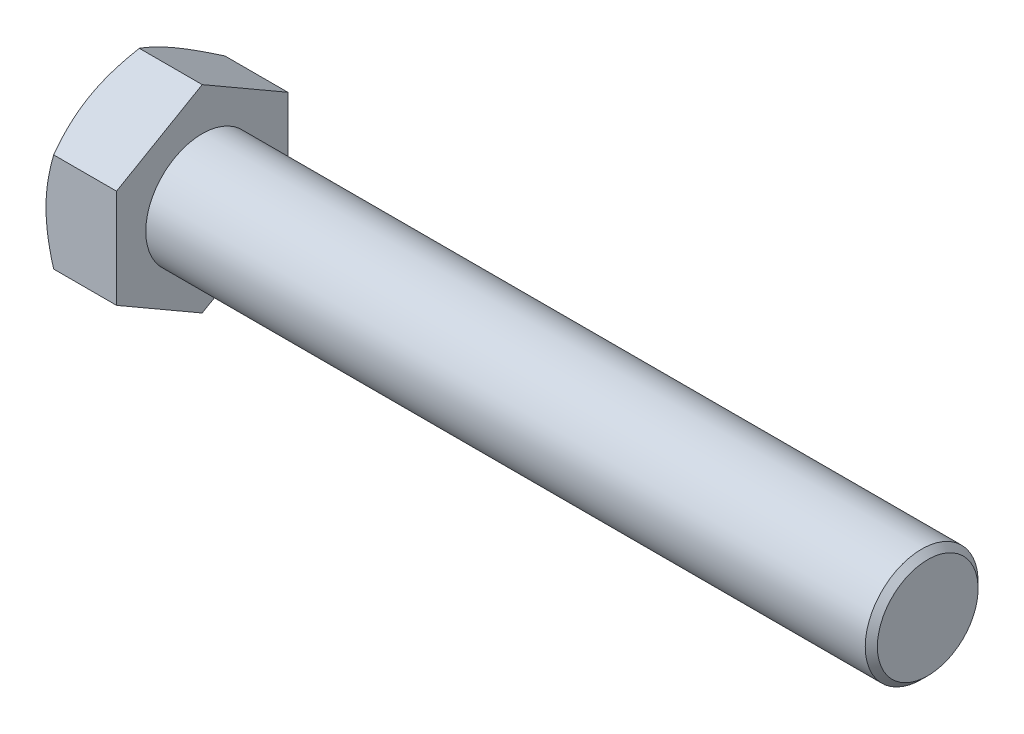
ISO-10303-21;
HEADER;
FILE_DESCRIPTION(('STEP AP214'),'2;1');
FILE_NAME('part.step','',(''),(''),'','','');
FILE_SCHEMA(('AUTOMOTIVE_DESIGN { 1 0 10303 214 1 1 1 1 }'));
ENDSEC;
DATA;
#1=APPLICATION_CONTEXT('core data for automotive mechanical design processes');
#2=APPLICATION_PROTOCOL_DEFINITION('international standard','automotive_design',2000,#1);
#3=PRODUCT_CONTEXT('',#1,'mechanical');
#4=PRODUCT('Part','Part','',(#3));
#5=PRODUCT_RELATED_PRODUCT_CATEGORY('part','',(#4));
#6=PRODUCT_DEFINITION_FORMATION('','',#4);
#7=PRODUCT_DEFINITION_CONTEXT('part definition',#1,'design');
#8=PRODUCT_DEFINITION('design','',#6,#7);
#9=PRODUCT_DEFINITION_SHAPE('','',#8);
#10=(LENGTH_UNIT() NAMED_UNIT(*) SI_UNIT(.MILLI.,.METRE.));
#11=(NAMED_UNIT(*) PLANE_ANGLE_UNIT() SI_UNIT($,.RADIAN.));
#12=(NAMED_UNIT(*) SI_UNIT($,.STERADIAN.) SOLID_ANGLE_UNIT());
#13=UNCERTAINTY_MEASURE_WITH_UNIT(LENGTH_MEASURE(1.E-05),#10,'distance_accuracy_value','');
#14=(GEOMETRIC_REPRESENTATION_CONTEXT(3) GLOBAL_UNCERTAINTY_ASSIGNED_CONTEXT((#13)) GLOBAL_UNIT_ASSIGNED_CONTEXT((#10,
#11,#12)) REPRESENTATION_CONTEXT('',''));
#15=CARTESIAN_POINT('',(0.,0.,0.));
#16=DIRECTION('',(0.,0.,1.));
#17=DIRECTION('',(1.,0.,0.));
#18=AXIS2_PLACEMENT_3D('',#15,#16,#17);
#19=CARTESIAN_POINT('',(35.,73.6121593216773,42.5));
#20=DIRECTION('',(1.,0.,0.));
#21=DIRECTION('',(0.,0.,-1.));
#22=AXIS2_PLACEMENT_3D('',#19,#20,#21);
#23=PLANE('',#22);
#24=DIRECTION('',(0.,0.5,0.866025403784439));
#25=VECTOR('',#24,1.);
#26=CARTESIAN_POINT('',(35.,24.5373864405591,-42.5));
#27=LINE('',#26,#25);
#28=CARTESIAN_POINT('',(35.,24.5373864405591,-42.5));
#29=VERTEX_POINT('',#28);
#30=CARTESIAN_POINT('',(35.,49.0747728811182,0.));
#31=VERTEX_POINT('',#30);
#32=EDGE_CURVE('E151',#29,#31,#27,.T.);
#33=ORIENTED_EDGE('',*,*,#32,.T.);
#34=DIRECTION('',(0.,-0.5,0.866025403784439));
#35=VECTOR('',#34,1.);
#36=CARTESIAN_POINT('',(35.,49.0747728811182,0.));
#37=LINE('',#36,#35);
#38=CARTESIAN_POINT('',(35.,24.5373864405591,42.5));
#39=VERTEX_POINT('',#38);
#40=EDGE_CURVE('E149',#31,#39,#37,.T.);
#41=ORIENTED_EDGE('',*,*,#40,.T.);
#42=DIRECTION('',(0.,-1.,0.));
#43=VECTOR('',#42,1.);
#44=CARTESIAN_POINT('',(35.,24.5373864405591,42.5));
#45=LINE('',#44,#43);
#46=CARTESIAN_POINT('',(35.,-24.5373864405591,42.5));
#47=VERTEX_POINT('',#46);
#48=EDGE_CURVE('E126',#39,#47,#45,.T.);
#49=ORIENTED_EDGE('',*,*,#48,.T.);
#50=DIRECTION('',(0.,-0.5,-0.866025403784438));
#51=VECTOR('',#50,1.);
#52=CARTESIAN_POINT('',(35.,-24.5373864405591,42.5));
#53=LINE('',#52,#51);
#54=CARTESIAN_POINT('',(35.,-49.0747728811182,0.));
#55=VERTEX_POINT('',#54);
#56=EDGE_CURVE('E146',#47,#55,#53,.T.);
#57=ORIENTED_EDGE('',*,*,#56,.T.);
#58=DIRECTION('',(0.,0.5,-0.866025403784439));
#59=VECTOR('',#58,1.);
#60=CARTESIAN_POINT('',(35.,-49.0747728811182,0.));
#61=LINE('',#60,#59);
#62=CARTESIAN_POINT('',(35.,-24.5373864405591,-42.5));
#63=VERTEX_POINT('',#62);
#64=EDGE_CURVE('E144',#55,#63,#61,.T.);
#65=ORIENTED_EDGE('',*,*,#64,.T.);
#66=DIRECTION('',(0.,1.,0.));
#67=VECTOR('',#66,1.);
#68=CARTESIAN_POINT('',(35.,-24.5373864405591,-42.5));
#69=LINE('',#68,#67);
#70=EDGE_CURVE('E142',#63,#29,#69,.T.);
#71=ORIENTED_EDGE('',*,*,#70,.T.);
#72=EDGE_LOOP('',(#33,#41,#49,#57,#65,#71));
#73=FACE_BOUND('',#72,.T.);
#74=CARTESIAN_POINT('',(35.,0.,0.));
#75=DIRECTION('',(1.,0.,0.));
#76=DIRECTION('',(0.,0.,-1.));
#77=AXIS2_PLACEMENT_3D('',#74,#75,#76);
#78=CIRCLE('',#77,28.);
#79=CARTESIAN_POINT('',(35.,0.,-28.));
#80=VERTEX_POINT('',#79);
#81=EDGE_CURVE('E244',#80,#80,#78,.F.);
#82=ORIENTED_EDGE('',*,*,#81,.T.);
#83=EDGE_LOOP('',(#82));
#84=FACE_BOUND('',#83,.T.);
#85=ADVANCED_FACE('F33',(#73,#84),#23,.T.);
#86=CARTESIAN_POINT('',(35.,24.5373864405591,-42.5));
#87=DIRECTION('',(0.,-0.866025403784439,0.5));
#88=DIRECTION('',(0.,-0.5,-0.866025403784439));
#89=AXIS2_PLACEMENT_3D('',#86,#87,#88);
#90=PLANE('',#89);
#91=CARTESIAN_POINT('',(3.79601355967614,49.074888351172,0.000199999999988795));
#92=CARTESIAN_POINT('',(3.4846612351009,48.5355680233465,-0.933930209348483));
#93=CARTESIAN_POINT('',(3.18743784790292,47.9941440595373,-1.87170402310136));
#94=CARTESIAN_POINT('',(2.62517624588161,46.90695457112,-3.75477145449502));
#95=CARTESIAN_POINT('',(2.36014861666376,46.361187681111,-4.70006743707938));
#96=CARTESIAN_POINT('',(1.86583585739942,45.264245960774,-6.60002622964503));
#97=CARTESIAN_POINT('',(1.63663608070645,44.7130614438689,-7.55470581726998));
#98=CARTESIAN_POINT('',(1.21891652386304,43.6068859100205,-9.4706580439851));
#99=CARTESIAN_POINT('',(1.0303926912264,43.0518952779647,-10.4319300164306));
#100=CARTESIAN_POINT('',(0.702027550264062,41.9522934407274,-12.3364962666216));
#101=CARTESIAN_POINT('',(0.561100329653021,41.407763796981,-13.2796492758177));
#102=CARTESIAN_POINT('',(0.324798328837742,40.3162094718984,-15.1702768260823));
#103=CARTESIAN_POINT('',(0.229424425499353,39.7691847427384,-16.1177514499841));
#104=CARTESIAN_POINT('',(0.0866371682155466,38.6742164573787,-18.0142921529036));
#105=CARTESIAN_POINT('',(0.0391668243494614,38.1262747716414,-18.9633549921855));
#106=CARTESIAN_POINT('',(-0.00679237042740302,37.0298856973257,-20.8623565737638));
#107=CARTESIAN_POINT('',(-0.00528273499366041,36.4814383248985,-21.8122952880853));
#108=CARTESIAN_POINT('',(0.0432959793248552,35.4561136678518,-23.5882096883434));
#109=CARTESIAN_POINT('',(0.0844413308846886,34.9791632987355,-24.4143119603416));
#110=CARTESIAN_POINT('',(0.20299436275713,34.0264000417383,-26.0645463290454));
#111=CARTESIAN_POINT('',(0.280401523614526,33.5505871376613,-26.8886784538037));
#112=CARTESIAN_POINT('',(0.470132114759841,32.6002802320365,-28.5346582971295));
#113=CARTESIAN_POINT('',(0.582487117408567,32.1257878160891,-29.3565032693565));
#114=CARTESIAN_POINT('',(0.840141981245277,31.1790583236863,-30.996286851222));
#115=CARTESIAN_POINT('',(0.98544170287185,30.7068212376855,-31.8142254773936));
#116=CARTESIAN_POINT('',(1.31023640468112,29.7545766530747,-33.4635614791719));
#117=CARTESIAN_POINT('',(1.49041542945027,29.2746277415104,-34.2948573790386));
#118=CARTESIAN_POINT('',(1.88016163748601,28.3176673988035,-35.9523613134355));
#119=CARTESIAN_POINT('',(2.08973280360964,27.8406563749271,-36.77856864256));
#120=CARTESIAN_POINT('',(2.53509189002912,26.8906903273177,-38.4239581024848));
#121=CARTESIAN_POINT('',(2.77082850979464,26.4177292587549,-39.2431507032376));
#122=CARTESIAN_POINT('',(3.26616671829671,25.4750783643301,-40.8758699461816));
#123=CARTESIAN_POINT('',(3.5257615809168,25.0053876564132,-41.6893981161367));
#124=CARTESIAN_POINT('',(3.79601355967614,24.5372709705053,-42.5002));
#125=B_SPLINE_CURVE_WITH_KNOTS('',3,(#91,#92,#93,#94,#95,#96,#97,#98,#99,#100,#101,#102,#103,
#104,#105,#106,#107,#108,#109,#110,#111,#112,#113,#114,#115,#116,#117,#118,#119,#120,#121,#122,
#123,#124),.UNSPECIFIED.,.F.,.F.,(4,2,2,2,2,2,2,2,2,2,2,2,2,2,2,2,4),(0.,3.36812217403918,
6.73734876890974,10.1144834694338,13.4912815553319,16.7848038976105,20.0783896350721,
23.3680524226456,26.6576135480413,29.52128658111,32.3849185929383,35.2511452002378,
38.1173596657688,41.0468447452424,43.9767271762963,46.9009634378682,49.824377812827),.UNSPECIFIED.);
#126=CARTESIAN_POINT('',(3.79594689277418,49.0747728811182,0.));
#127=VERTEX_POINT('',#126);
#128=CARTESIAN_POINT('',(0.,36.8060796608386,-21.25));
#129=VERTEX_POINT('',#128);
#130=EDGE_CURVE('E50',#127,#129,#125,.T.);
#131=ORIENTED_EDGE('',*,*,#130,.F.);
#132=DIRECTION('',(-1.,0.,0.));
#133=VECTOR('',#132,1.);
#134=CARTESIAN_POINT('',(35.,49.0747728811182,0.));
#135=LINE('',#134,#133);
#136=EDGE_CURVE('E127',#31,#127,#135,.T.);
#137=ORIENTED_EDGE('',*,*,#136,.F.);
#138=ORIENTED_EDGE('',*,*,#32,.F.);
#139=DIRECTION('',(-1.,0.,0.));
#140=VECTOR('',#139,1.);
#141=CARTESIAN_POINT('',(35.,24.5373864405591,-42.5));
#142=LINE('',#141,#140);
#143=CARTESIAN_POINT('',(3.79594689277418,24.5373864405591,-42.5));
#144=VERTEX_POINT('',#143);
#145=EDGE_CURVE('E139',#29,#144,#142,.T.);
#146=ORIENTED_EDGE('',*,*,#145,.T.);
#147=EDGE_CURVE('E198',#129,#144,#125,.T.);
#148=ORIENTED_EDGE('',*,*,#147,.F.);
#149=EDGE_LOOP('',(#131,#137,#138,#146,#148));
#150=FACE_BOUND('',#149,.T.);
#151=ADVANCED_FACE('F35',(#150),#90,.F.);
#152=CARTESIAN_POINT('',(35.,49.0747728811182,0.));
#153=DIRECTION('',(0.,-0.866025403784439,-0.5));
#154=DIRECTION('',(0.,0.5,-0.866025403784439));
#155=AXIS2_PLACEMENT_3D('',#152,#153,#154);
#156=PLANE('',#155);
#157=CARTESIAN_POINT('',(3.79601355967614,24.5372709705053,42.5002));
#158=CARTESIAN_POINT('',(3.48466123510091,25.0765912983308,41.5660697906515));
#159=CARTESIAN_POINT('',(3.18743784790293,25.61801526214,40.6282959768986));
#160=CARTESIAN_POINT('',(2.62517624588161,26.7052047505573,38.745228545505));
#161=CARTESIAN_POINT('',(2.36014861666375,27.2509716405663,37.7999325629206));
#162=CARTESIAN_POINT('',(1.86583585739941,28.3479133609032,35.899973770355));
#163=CARTESIAN_POINT('',(1.63663608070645,28.8990978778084,34.94529418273));
#164=CARTESIAN_POINT('',(1.21891652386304,30.0052734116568,33.0293419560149));
#165=CARTESIAN_POINT('',(1.0303926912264,30.5602640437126,32.0680699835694));
#166=CARTESIAN_POINT('',(0.702027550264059,31.6598658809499,30.1635037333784));
#167=CARTESIAN_POINT('',(0.56110032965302,32.2043955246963,29.2203507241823));
#168=CARTESIAN_POINT('',(0.324798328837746,33.2959498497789,27.3297231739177));
#169=CARTESIAN_POINT('',(0.229424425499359,33.8429745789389,26.3822485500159));
#170=CARTESIAN_POINT('',(0.0866371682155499,34.9379428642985,24.4857078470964));
#171=CARTESIAN_POINT('',(0.0391668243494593,35.4858845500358,23.5366450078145));
#172=CARTESIAN_POINT('',(-0.00679237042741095,36.5822736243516,21.6376434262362));
#173=CARTESIAN_POINT('',(-0.00528273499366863,37.1307209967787,20.6877047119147));
#174=CARTESIAN_POINT('',(0.0432959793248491,38.1560456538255,18.9117903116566));
#175=CARTESIAN_POINT('',(0.0844413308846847,38.6329960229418,18.0856880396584));
#176=CARTESIAN_POINT('',(0.202994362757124,39.585759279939,16.4354536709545));
#177=CARTESIAN_POINT('',(0.280401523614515,40.061572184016,15.6113215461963));
#178=CARTESIAN_POINT('',(0.470132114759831,41.0118790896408,13.9653417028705));
#179=CARTESIAN_POINT('',(0.582487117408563,41.4863715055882,13.1434967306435));
#180=CARTESIAN_POINT('',(0.840141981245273,42.433100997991,11.503713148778));
#181=CARTESIAN_POINT('',(0.985441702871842,42.9053380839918,10.6857745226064));
#182=CARTESIAN_POINT('',(1.31023640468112,43.8575826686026,9.03643852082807));
#183=CARTESIAN_POINT('',(1.49041542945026,44.3375315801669,8.20514262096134));
#184=CARTESIAN_POINT('',(1.88016163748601,45.2944919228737,6.54763868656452));
#185=CARTESIAN_POINT('',(2.08973280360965,45.7715029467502,5.72143135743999));
#186=CARTESIAN_POINT('',(2.53509189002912,46.7214689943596,4.07604189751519));
#187=CARTESIAN_POINT('',(2.77082850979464,47.1944300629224,3.2568492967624));
#188=CARTESIAN_POINT('',(3.2661667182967,48.1370809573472,1.62413005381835));
#189=CARTESIAN_POINT('',(3.5257615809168,48.6067716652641,0.810601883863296));
#190=CARTESIAN_POINT('',(3.79601355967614,49.074888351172,-0.000200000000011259));
#191=B_SPLINE_CURVE_WITH_KNOTS('',3,(#157,#158,#159,#160,#161,#162,#163,#164,#165,#166,#167,
#168,#169,#170,#171,#172,#173,#174,#175,#176,#177,#178,#179,#180,#181,#182,#183,#184,#185,#186,
#187,#188,#189,#190),.UNSPECIFIED.,.F.,.F.,(4,2,2,2,2,2,2,2,2,2,2,2,2,2,2,2,4),(0.,
3.36812217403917,6.73734876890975,10.1144834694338,13.4912815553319,16.7848038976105,
20.0783896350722,23.3680524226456,26.6576135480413,29.52128658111,32.3849185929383,
35.2511452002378,38.1173596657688,41.0468447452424,43.9767271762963,46.9009634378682,
49.824377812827),.UNSPECIFIED.);
#192=CARTESIAN_POINT('',(3.79594689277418,24.5373864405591,42.5));
#193=VERTEX_POINT('',#192);
#194=CARTESIAN_POINT('',(0.,36.8060796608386,21.25));
#195=VERTEX_POINT('',#194);
#196=EDGE_CURVE('E57',#193,#195,#191,.T.);
#197=ORIENTED_EDGE('',*,*,#196,.F.);
#198=DIRECTION('',(-1.,0.,0.));
#199=VECTOR('',#198,1.);
#200=CARTESIAN_POINT('',(35.,24.5373864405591,42.5));
#201=LINE('',#200,#199);
#202=EDGE_CURVE('E119',#39,#193,#201,.T.);
#203=ORIENTED_EDGE('',*,*,#202,.F.);
#204=ORIENTED_EDGE('',*,*,#40,.F.);
#205=ORIENTED_EDGE('',*,*,#136,.T.);
#206=EDGE_CURVE('E122',#195,#127,#191,.T.);
#207=ORIENTED_EDGE('',*,*,#206,.F.);
#208=EDGE_LOOP('',(#197,#203,#204,#205,#207));
#209=FACE_BOUND('',#208,.T.);
#210=ADVANCED_FACE('F118',(#209),#156,.F.);
#211=CARTESIAN_POINT('',(35.,24.5373864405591,42.5));
#212=DIRECTION('',(0.,0.,-1.));
#213=DIRECTION('',(-1.,0.,0.));
#214=AXIS2_PLACEMENT_3D('',#211,#212,#213);
#215=PLANE('',#214);
#216=CARTESIAN_POINT('',(20.3373849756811,-65.0767648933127,42.5));
#217=CARTESIAN_POINT('',(19.8864107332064,-64.1438049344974,42.5));
#218=CARTESIAN_POINT('',(19.4377629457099,-63.2097164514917,42.5));
#219=CARTESIAN_POINT('',(18.5456711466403,-61.3390459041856,42.5));
#220=CARTESIAN_POINT('',(18.1022271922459,-60.4024638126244,42.5));
#221=CARTESIAN_POINT('',(17.2210290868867,-58.5264308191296,42.5));
#222=CARTESIAN_POINT('',(16.7832759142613,-57.5869794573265,42.5));
#223=CARTESIAN_POINT('',(15.9141917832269,-55.7051120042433,42.5));
#224=CARTESIAN_POINT('',(15.482860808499,-54.762695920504,42.5));
#225=CARTESIAN_POINT('',(14.6249118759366,-52.8692072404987,42.5));
#226=CARTESIAN_POINT('',(14.1983350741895,-51.9181159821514,42.5));
#227=CARTESIAN_POINT('',(13.3532955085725,-50.0123364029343,42.5));
#228=CARTESIAN_POINT('',(12.9348327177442,-49.0576480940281,42.5));
#229=CARTESIAN_POINT('',(12.1070331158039,-47.1443706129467,42.5));
#230=CARTESIAN_POINT('',(11.6976958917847,-46.1857816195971,42.5));
#231=CARTESIAN_POINT('',(10.8892709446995,-44.2642864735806,42.5));
#232=CARTESIAN_POINT('',(10.490183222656,-43.301380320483,42.5));
#233=CARTESIAN_POINT('',(9.69873914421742,-41.358991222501,42.5));
#234=CARTESIAN_POINT('',(9.30652571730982,-40.3794499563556,42.5));
#235=CARTESIAN_POINT('',(8.53551485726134,-38.415091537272,42.5));
#236=CARTESIAN_POINT('',(8.15671744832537,-37.4302743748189,42.5));
#237=CARTESIAN_POINT('',(7.41429261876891,-35.4547841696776,42.5));
#238=CARTESIAN_POINT('',(7.0506671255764,-34.464110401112,42.5));
#239=CARTESIAN_POINT('',(6.34070151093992,-32.4765835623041,42.5));
#240=CARTESIAN_POINT('',(5.99436131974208,-31.4797305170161,42.5));
#241=CARTESIAN_POINT('',(5.32202587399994,-29.4815411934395,42.5));
#242=CARTESIAN_POINT('',(4.99598844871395,-28.4802191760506,42.5));
#243=CARTESIAN_POINT('',(4.366091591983,-26.4706437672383,42.5));
#244=CARTESIAN_POINT('',(4.06223253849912,-25.4623902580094,42.5));
#245=CARTESIAN_POINT('',(3.18838018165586,-22.4272420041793,42.5));
#246=CARTESIAN_POINT('',(2.65584808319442,-20.3891895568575,42.5));
#247=CARTESIAN_POINT('',(1.95165311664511,-17.3102620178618,42.5));
#248=CARTESIAN_POINT('',(1.73265261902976,-16.2800927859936,42.5));
#249=CARTESIAN_POINT('',(1.32964364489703,-14.2128889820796,42.5));
#250=CARTESIAN_POINT('',(1.14563438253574,-13.1758545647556,42.5));
#251=CARTESIAN_POINT('',(0.81587021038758,-11.0956277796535,42.5));
#252=CARTESIAN_POINT('',(0.670117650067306,-10.0524350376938,42.5));
#253=CARTESIAN_POINT('',(0.419794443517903,-7.96108365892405,42.5));
#254=CARTESIAN_POINT('',(0.315223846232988,-6.91292501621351,42.5));
#255=CARTESIAN_POINT('',(0.150079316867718,-4.81982610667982,42.5));
#256=CARTESIAN_POINT('',(0.0892300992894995,-3.77490769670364,42.5));
#257=CARTESIAN_POINT('',(0.0118497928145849,-1.68343343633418,42.5));
#258=CARTESIAN_POINT('',(-0.00468196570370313,-0.636877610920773,42.5));
#259=CARTESIAN_POINT('',(0.00695889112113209,1.45568967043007,42.5));
#260=CARTESIAN_POINT('',(0.0351191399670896,2.5017011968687,42.5));
#261=CARTESIAN_POINT('',(0.135465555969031,4.59165687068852,42.5));
#262=CARTESIAN_POINT('',(0.20765366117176,5.63560092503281,42.5));
#263=CARTESIAN_POINT('',(0.367668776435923,7.42128904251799,42.5));
#264=CARTESIAN_POINT('',(0.445101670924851,8.16398533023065,42.5));
#265=CARTESIAN_POINT('',(0.620690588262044,9.6469331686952,42.5));
#266=CARTESIAN_POINT('',(0.718847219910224,10.3871846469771,42.5));
#267=CARTESIAN_POINT('',(1.04295711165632,12.6037313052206,42.5));
#268=CARTESIAN_POINT('',(1.29854540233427,14.0757647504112,42.5));
#269=CARTESIAN_POINT('',(1.88009693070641,17.0089295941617,42.5));
#270=CARTESIAN_POINT('',(2.20621102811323,18.4700305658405,42.5));
#271=CARTESIAN_POINT('',(2.91867799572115,21.3773037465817,42.5));
#272=CARTESIAN_POINT('',(3.30502860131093,22.8234765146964,42.5));
#273=CARTESIAN_POINT('',(4.13838357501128,25.7349070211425,42.5));
#274=CARTESIAN_POINT('',(4.58659928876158,27.1998153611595,42.5));
#275=CARTESIAN_POINT('',(5.52765504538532,30.1153033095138,42.5));
#276=CARTESIAN_POINT('',(6.02049911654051,31.5658816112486,42.5));
#277=CARTESIAN_POINT('',(6.78613919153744,33.7277418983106,42.5));
#278=CARTESIAN_POINT('',(7.04497697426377,34.444015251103,42.5));
#279=CARTESIAN_POINT('',(7.57104172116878,35.8734846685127,42.5));
#280=CARTESIAN_POINT('',(7.83826874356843,36.5866807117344,42.5));
#281=CARTESIAN_POINT('',(8.38027540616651,38.0099126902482,42.5));
#282=CARTESIAN_POINT('',(8.65505243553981,38.7199496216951,42.5));
#283=CARTESIAN_POINT('',(9.21159032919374,40.1372592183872,42.5));
#284=CARTESIAN_POINT('',(9.49335099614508,40.8445319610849,42.5));
#285=CARTESIAN_POINT('',(9.77828319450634,41.5505180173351,42.5));
#286=B_SPLINE_CURVE_WITH_KNOTS('',3,(#216,#217,#218,#219,#220,#221,#222,#223,#224,#225,#226,
#227,#228,#229,#230,#231,#232,#233,#234,#235,#236,#237,#238,#239,#240,#241,#242,#243,#244,#245,
#246,#247,#248,#249,#250,#251,#252,#253,#254,#255,#256,#257,#258,#259,#260,#261,#262,#263,#264,
#265,#266,#267,#268,#269,#270,#271,#272,#273,#274,#275,#276,#277,#278,#279,#280,#281,#282,#283,
#284,#285),.UNSPECIFIED.,.F.,.F.,(4,2,2,2,2,2,2,2,2,2,2,2,2,2,2,2,2,2,2,2,2,2,2,2,2,2,2,2,2,2,2,
2,2,2,4),(0.,3.10872020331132,6.21747453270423,9.32675642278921,12.4360304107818,
15.5631168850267,18.6901929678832,21.8171272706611,24.9440618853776,28.1094116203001,
31.2747670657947,34.4405234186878,37.6062669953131,40.7651991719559,43.924185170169,
50.2397177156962,53.398810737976,56.5578328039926,59.7170488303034,62.8762686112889,
66.0154182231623,69.1545204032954,72.292754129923,75.4311260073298,77.6710037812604,
79.9109473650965,84.390996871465,88.8807260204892,93.3702864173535,97.9652822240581,
102.560693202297,104.845472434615,107.130267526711,109.414282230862,111.698232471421),.UNSPECIFIED.);
#287=CARTESIAN_POINT('',(3.79594689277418,-24.5373864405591,42.5));
#288=VERTEX_POINT('',#287);
#289=CARTESIAN_POINT('',(0.,0.,42.5));
#290=VERTEX_POINT('',#289);
#291=EDGE_CURVE('E112',#288,#290,#286,.T.);
#292=ORIENTED_EDGE('',*,*,#291,.F.);
#293=DIRECTION('',(-1.,0.,0.));
#294=VECTOR('',#293,1.);
#295=CARTESIAN_POINT('',(35.,-24.5373864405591,42.5));
#296=LINE('',#295,#294);
#297=EDGE_CURVE('E128',#47,#288,#296,.T.);
#298=ORIENTED_EDGE('',*,*,#297,.F.);
#299=ORIENTED_EDGE('',*,*,#48,.F.);
#300=ORIENTED_EDGE('',*,*,#202,.T.);
#301=EDGE_CURVE('E104',#290,#193,#286,.T.);
#302=ORIENTED_EDGE('',*,*,#301,.F.);
#303=EDGE_LOOP('',(#292,#298,#299,#300,#302));
#304=FACE_BOUND('',#303,.T.);
#305=ADVANCED_FACE('F124',(#304),#215,.F.);
#306=CARTESIAN_POINT('',(35.,-24.5373864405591,42.5));
#307=DIRECTION('',(0.,0.866025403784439,-0.5));
#308=DIRECTION('',(0.,0.5,0.866025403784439));
#309=AXIS2_PLACEMENT_3D('',#306,#307,#308);
#310=PLANE('',#309);
#311=CARTESIAN_POINT('',(3.79601355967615,-49.074888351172,-0.000199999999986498));
#312=CARTESIAN_POINT('',(3.48466123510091,-48.5355680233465,0.933930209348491));
#313=CARTESIAN_POINT('',(3.18743784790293,-47.9941440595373,1.87170402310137));
#314=CARTESIAN_POINT('',(2.62517624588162,-46.90695457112,3.75477145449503));
#315=CARTESIAN_POINT('',(2.36014861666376,-46.361187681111,4.70006743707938));
#316=CARTESIAN_POINT('',(1.86583585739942,-45.264245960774,6.60002622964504));
#317=CARTESIAN_POINT('',(1.63663608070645,-44.7130614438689,7.55470581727));
#318=CARTESIAN_POINT('',(1.21891652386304,-43.6068859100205,9.47065804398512));
#319=CARTESIAN_POINT('',(1.03039269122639,-43.0518952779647,10.4319300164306));
#320=CARTESIAN_POINT('',(0.702027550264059,-41.9522934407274,12.3364962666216));
#321=CARTESIAN_POINT('',(0.561100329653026,-41.407763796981,13.2796492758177));
#322=CARTESIAN_POINT('',(0.324798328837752,-40.3162094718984,15.1702768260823));
#323=CARTESIAN_POINT('',(0.22942442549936,-39.7691847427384,16.1177514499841));
#324=CARTESIAN_POINT('',(0.0866371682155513,-38.6742164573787,18.0142921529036));
#325=CARTESIAN_POINT('',(0.0391668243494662,-38.1262747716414,18.9633549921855));
#326=CARTESIAN_POINT('',(-0.00679237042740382,-37.0298856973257,20.8623565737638));
#327=CARTESIAN_POINT('',(-0.00528273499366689,-36.4814383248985,21.8122952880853));
#328=CARTESIAN_POINT('',(0.0432959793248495,-35.4561136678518,23.5882096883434));
#329=CARTESIAN_POINT('',(0.084441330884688,-34.9791632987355,24.4143119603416));
#330=CARTESIAN_POINT('',(0.202994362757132,-34.0264000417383,26.0645463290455));
#331=CARTESIAN_POINT('',(0.280401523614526,-33.5505871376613,26.8886784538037));
#332=CARTESIAN_POINT('',(0.470132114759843,-32.6002802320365,28.5346582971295));
#333=CARTESIAN_POINT('',(0.582487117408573,-32.1257878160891,29.3565032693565));
#334=CARTESIAN_POINT('',(0.840141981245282,-31.1790583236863,30.996286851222));
#335=CARTESIAN_POINT('',(0.98544170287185,-30.7068212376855,31.8142254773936));
#336=CARTESIAN_POINT('',(1.31023640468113,-29.7545766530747,33.4635614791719));
#337=CARTESIAN_POINT('',(1.49041542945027,-29.2746277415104,34.2948573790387));
#338=CARTESIAN_POINT('',(1.88016163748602,-28.3176673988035,35.9523613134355));
#339=CARTESIAN_POINT('',(2.08973280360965,-27.8406563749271,36.77856864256));
#340=CARTESIAN_POINT('',(2.53509189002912,-26.8906903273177,38.4239581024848));
#341=CARTESIAN_POINT('',(2.77082850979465,-26.4177292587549,39.2431507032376));
#342=CARTESIAN_POINT('',(3.26616671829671,-25.4750783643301,40.8758699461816));
#343=CARTESIAN_POINT('',(3.52576158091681,-25.0053876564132,41.6893981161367));
#344=CARTESIAN_POINT('',(3.79601355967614,-24.5372709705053,42.5002));
#345=B_SPLINE_CURVE_WITH_KNOTS('',3,(#311,#312,#313,#314,#315,#316,#317,#318,#319,#320,#321,
#322,#323,#324,#325,#326,#327,#328,#329,#330,#331,#332,#333,#334,#335,#336,#337,#338,#339,#340,
#341,#342,#343,#344),.UNSPECIFIED.,.F.,.F.,(4,2,2,2,2,2,2,2,2,2,2,2,2,2,2,2,4),(0.,
3.36812217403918,6.73734876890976,10.1144834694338,13.4912815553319,16.7848038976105,
20.0783896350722,23.3680524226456,26.6576135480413,29.52128658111,32.3849185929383,
35.2511452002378,38.1173596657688,41.0468447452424,43.9767271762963,46.9009634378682,
49.824377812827),.UNSPECIFIED.);
#346=CARTESIAN_POINT('',(3.79594689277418,-49.0747728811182,0.));
#347=VERTEX_POINT('',#346);
#348=CARTESIAN_POINT('',(0.,-36.8060796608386,21.25));
#349=VERTEX_POINT('',#348);
#350=EDGE_CURVE('E203',#347,#349,#345,.T.);
#351=ORIENTED_EDGE('',*,*,#350,.F.);
#352=DIRECTION('',(-1.,0.,0.));
#353=VECTOR('',#352,1.);
#354=CARTESIAN_POINT('',(35.,-49.0747728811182,0.));
#355=LINE('',#354,#353);
#356=EDGE_CURVE('E131',#55,#347,#355,.T.);
#357=ORIENTED_EDGE('',*,*,#356,.F.);
#358=ORIENTED_EDGE('',*,*,#56,.F.);
#359=ORIENTED_EDGE('',*,*,#297,.T.);
#360=EDGE_CURVE('E113',#349,#288,#345,.T.);
#361=ORIENTED_EDGE('',*,*,#360,.F.);
#362=EDGE_LOOP('',(#351,#357,#358,#359,#361));
#363=FACE_BOUND('',#362,.T.);
#364=ADVANCED_FACE('F209',(#363),#310,.F.);
#365=CARTESIAN_POINT('',(35.,-49.0747728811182,0.));
#366=DIRECTION('',(0.,0.866025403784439,0.5));
#367=DIRECTION('',(0.,-0.5,0.866025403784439));
#368=AXIS2_PLACEMENT_3D('',#365,#366,#367);
#369=PLANE('',#368);
#370=CARTESIAN_POINT('',(3.79601355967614,-24.5372709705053,-42.5002));
#371=CARTESIAN_POINT('',(3.48466123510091,-25.0765912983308,-41.5660697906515));
#372=CARTESIAN_POINT('',(3.18743784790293,-25.61801526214,-40.6282959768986));
#373=CARTESIAN_POINT('',(2.62517624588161,-26.7052047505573,-38.745228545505));
#374=CARTESIAN_POINT('',(2.36014861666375,-27.2509716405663,-37.7999325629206));
#375=CARTESIAN_POINT('',(1.86583585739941,-28.3479133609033,-35.899973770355));
#376=CARTESIAN_POINT('',(1.63663608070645,-28.8990978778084,-34.94529418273));
#377=CARTESIAN_POINT('',(1.21891652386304,-30.0052734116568,-33.0293419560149));
#378=CARTESIAN_POINT('',(1.0303926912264,-30.5602640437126,-32.0680699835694));
#379=CARTESIAN_POINT('',(0.702027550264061,-31.6598658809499,-30.1635037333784));
#380=CARTESIAN_POINT('',(0.561100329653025,-32.2043955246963,-29.2203507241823));
#381=CARTESIAN_POINT('',(0.32479832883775,-33.2959498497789,-27.3297231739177));
#382=CARTESIAN_POINT('',(0.229424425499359,-33.8429745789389,-26.3822485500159));
#383=CARTESIAN_POINT('',(0.0866371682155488,-34.9379428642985,-24.4857078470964));
#384=CARTESIAN_POINT('',(0.0391668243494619,-35.4858845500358,-23.5366450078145));
#385=CARTESIAN_POINT('',(-0.00679237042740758,-36.5822736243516,-21.6376434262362));
#386=CARTESIAN_POINT('',(-0.00528273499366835,-37.1307209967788,-20.6877047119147));
#387=CARTESIAN_POINT('',(0.0432959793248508,-38.1560456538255,-18.9117903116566));
#388=CARTESIAN_POINT('',(0.0844413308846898,-38.6329960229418,-18.0856880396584));
#389=CARTESIAN_POINT('',(0.202994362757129,-39.585759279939,-16.4354536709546));
#390=CARTESIAN_POINT('',(0.280401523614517,-40.061572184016,-15.6113215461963));
#391=CARTESIAN_POINT('',(0.470132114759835,-41.0118790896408,-13.9653417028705));
#392=CARTESIAN_POINT('',(0.582487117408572,-41.4863715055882,-13.1434967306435));
#393=CARTESIAN_POINT('',(0.840141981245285,-42.433100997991,-11.503713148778));
#394=CARTESIAN_POINT('',(0.985441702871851,-42.9053380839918,-10.6857745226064));
#395=CARTESIAN_POINT('',(1.31023640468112,-43.8575826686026,-9.03643852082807));
#396=CARTESIAN_POINT('',(1.49041542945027,-44.3375315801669,-8.20514262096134));
#397=CARTESIAN_POINT('',(1.88016163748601,-45.2944919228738,-6.54763868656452));
#398=CARTESIAN_POINT('',(2.08973280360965,-45.7715029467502,-5.72143135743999));
#399=CARTESIAN_POINT('',(2.53509189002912,-46.7214689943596,-4.07604189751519));
#400=CARTESIAN_POINT('',(2.77082850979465,-47.1944300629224,-3.2568492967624));
#401=CARTESIAN_POINT('',(3.26616671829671,-48.1370809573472,-1.62413005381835));
#402=CARTESIAN_POINT('',(3.52576158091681,-48.6067716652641,-0.810601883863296));
#403=CARTESIAN_POINT('',(3.79601355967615,-49.074888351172,0.000200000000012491));
#404=B_SPLINE_CURVE_WITH_KNOTS('',3,(#370,#371,#372,#373,#374,#375,#376,#377,#378,#379,#380,
#381,#382,#383,#384,#385,#386,#387,#388,#389,#390,#391,#392,#393,#394,#395,#396,#397,#398,#399,
#400,#401,#402,#403),.UNSPECIFIED.,.F.,.F.,(4,2,2,2,2,2,2,2,2,2,2,2,2,2,2,2,4),(0.,
3.36812217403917,6.73734876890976,10.1144834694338,13.4912815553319,16.7848038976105,
20.0783896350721,23.3680524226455,26.6576135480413,29.52128658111,32.3849185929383,
35.2511452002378,38.1173596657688,41.0468447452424,43.9767271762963,46.9009634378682,
49.824377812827),.UNSPECIFIED.);
#405=CARTESIAN_POINT('',(3.79594689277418,-24.5373864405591,-42.5));
#406=VERTEX_POINT('',#405);
#407=CARTESIAN_POINT('',(0.,-36.8060796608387,-21.25));
#408=VERTEX_POINT('',#407);
#409=EDGE_CURVE('E190',#406,#408,#404,.T.);
#410=ORIENTED_EDGE('',*,*,#409,.F.);
#411=DIRECTION('',(-1.,0.,0.));
#412=VECTOR('',#411,1.);
#413=CARTESIAN_POINT('',(35.,-24.5373864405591,-42.5));
#414=LINE('',#413,#412);
#415=EDGE_CURVE('E136',#63,#406,#414,.T.);
#416=ORIENTED_EDGE('',*,*,#415,.F.);
#417=ORIENTED_EDGE('',*,*,#64,.F.);
#418=ORIENTED_EDGE('',*,*,#356,.T.);
#419=EDGE_CURVE('E208',#408,#347,#404,.T.);
#420=ORIENTED_EDGE('',*,*,#419,.F.);
#421=EDGE_LOOP('',(#410,#416,#417,#418,#420));
#422=FACE_BOUND('',#421,.T.);
#423=ADVANCED_FACE('F212',(#422),#369,.F.);
#424=CARTESIAN_POINT('',(35.,-24.5373864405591,-42.5));
#425=DIRECTION('',(0.,0.,1.));
#426=DIRECTION('',(1.,0.,0.));
#427=AXIS2_PLACEMENT_3D('',#424,#425,#426);
#428=PLANE('',#427);
#429=CARTESIAN_POINT('',(20.3373849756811,-65.0767648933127,-42.5));
#430=CARTESIAN_POINT('',(19.8864107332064,-64.1438049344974,-42.5));
#431=CARTESIAN_POINT('',(19.4377629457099,-63.2097164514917,-42.5));
#432=CARTESIAN_POINT('',(18.5456711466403,-61.3390459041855,-42.5));
#433=CARTESIAN_POINT('',(18.1022271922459,-60.4024638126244,-42.5));
#434=CARTESIAN_POINT('',(17.2210290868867,-58.5264308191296,-42.5));
#435=CARTESIAN_POINT('',(16.7832759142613,-57.5869794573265,-42.5));
#436=CARTESIAN_POINT('',(15.9141917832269,-55.7051120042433,-42.5));
#437=CARTESIAN_POINT('',(15.482860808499,-54.762695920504,-42.5));
#438=CARTESIAN_POINT('',(14.6249118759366,-52.8692072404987,-42.5));
#439=CARTESIAN_POINT('',(14.1983350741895,-51.9181159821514,-42.5));
#440=CARTESIAN_POINT('',(13.3532955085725,-50.0123364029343,-42.5));
#441=CARTESIAN_POINT('',(12.9348327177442,-49.0576480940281,-42.5));
#442=CARTESIAN_POINT('',(12.1070331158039,-47.1443706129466,-42.5));
#443=CARTESIAN_POINT('',(11.6976958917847,-46.1857816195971,-42.5));
#444=CARTESIAN_POINT('',(10.8892709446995,-44.2642864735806,-42.5));
#445=CARTESIAN_POINT('',(10.490183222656,-43.301380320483,-42.5));
#446=CARTESIAN_POINT('',(9.69873914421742,-41.358991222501,-42.5));
#447=CARTESIAN_POINT('',(9.30652571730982,-40.3794499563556,-42.5));
#448=CARTESIAN_POINT('',(8.53551485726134,-38.415091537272,-42.5));
#449=CARTESIAN_POINT('',(8.15671744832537,-37.4302743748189,-42.5));
#450=CARTESIAN_POINT('',(7.4142926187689,-35.4547841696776,-42.5));
#451=CARTESIAN_POINT('',(7.05066712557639,-34.464110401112,-42.5));
#452=CARTESIAN_POINT('',(6.34070151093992,-32.4765835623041,-42.5));
#453=CARTESIAN_POINT('',(5.99436131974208,-31.4797305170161,-42.5));
#454=CARTESIAN_POINT('',(5.32202587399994,-29.4815411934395,-42.5));
#455=CARTESIAN_POINT('',(4.99598844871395,-28.4802191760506,-42.5));
#456=CARTESIAN_POINT('',(4.366091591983,-26.4706437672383,-42.5));
#457=CARTESIAN_POINT('',(4.06223253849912,-25.4623902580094,-42.5));
#458=CARTESIAN_POINT('',(3.18838018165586,-22.4272420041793,-42.5));
#459=CARTESIAN_POINT('',(2.65584808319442,-20.3891895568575,-42.5));
#460=CARTESIAN_POINT('',(1.95165311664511,-17.3102620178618,-42.5));
#461=CARTESIAN_POINT('',(1.73265261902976,-16.2800927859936,-42.5));
#462=CARTESIAN_POINT('',(1.32964364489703,-14.2128889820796,-42.5));
#463=CARTESIAN_POINT('',(1.14563438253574,-13.1758545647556,-42.5));
#464=CARTESIAN_POINT('',(0.81587021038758,-11.0956277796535,-42.5));
#465=CARTESIAN_POINT('',(0.670117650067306,-10.0524350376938,-42.5));
#466=CARTESIAN_POINT('',(0.419794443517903,-7.96108365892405,-42.5));
#467=CARTESIAN_POINT('',(0.315223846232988,-6.91292501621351,-42.5));
#468=CARTESIAN_POINT('',(0.150079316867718,-4.81982610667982,-42.5));
#469=CARTESIAN_POINT('',(0.0892300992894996,-3.77490769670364,-42.5));
#470=CARTESIAN_POINT('',(0.0118497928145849,-1.68343343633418,-42.5));
#471=CARTESIAN_POINT('',(-0.00468196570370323,-0.636877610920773,-42.5));
#472=CARTESIAN_POINT('',(0.00695889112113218,1.45568967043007,-42.5));
#473=CARTESIAN_POINT('',(0.0351191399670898,2.5017011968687,-42.5));
#474=CARTESIAN_POINT('',(0.135465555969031,4.59165687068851,-42.5));
#475=CARTESIAN_POINT('',(0.207653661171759,5.6356009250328,-42.5));
#476=CARTESIAN_POINT('',(0.367668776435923,7.42128904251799,-42.5));
#477=CARTESIAN_POINT('',(0.445101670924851,8.16398533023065,-42.5));
#478=CARTESIAN_POINT('',(0.620690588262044,9.6469331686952,-42.5));
#479=CARTESIAN_POINT('',(0.718847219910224,10.3871846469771,-42.5));
#480=CARTESIAN_POINT('',(1.04295711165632,12.6037313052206,-42.5));
#481=CARTESIAN_POINT('',(1.29854540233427,14.0757647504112,-42.5));
#482=CARTESIAN_POINT('',(1.8800969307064,17.0089295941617,-42.5));
#483=CARTESIAN_POINT('',(2.20621102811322,18.4700305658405,-42.5));
#484=CARTESIAN_POINT('',(2.91867799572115,21.3773037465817,-42.5));
#485=CARTESIAN_POINT('',(3.30502860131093,22.8234765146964,-42.5));
#486=CARTESIAN_POINT('',(4.13838357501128,25.7349070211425,-42.5));
#487=CARTESIAN_POINT('',(4.58659928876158,27.1998153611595,-42.5));
#488=CARTESIAN_POINT('',(5.52765504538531,30.1153033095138,-42.5));
#489=CARTESIAN_POINT('',(6.0204991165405,31.5658816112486,-42.5));
#490=CARTESIAN_POINT('',(6.78613919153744,33.7277418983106,-42.5));
#491=CARTESIAN_POINT('',(7.04497697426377,34.444015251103,-42.5));
#492=CARTESIAN_POINT('',(7.57104172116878,35.8734846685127,-42.5));
#493=CARTESIAN_POINT('',(7.83826874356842,36.5866807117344,-42.5));
#494=CARTESIAN_POINT('',(8.3802754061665,38.0099126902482,-42.5));
#495=CARTESIAN_POINT('',(8.6550524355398,38.7199496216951,-42.5));
#496=CARTESIAN_POINT('',(9.21159032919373,40.1372592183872,-42.5));
#497=CARTESIAN_POINT('',(9.49335099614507,40.8445319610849,-42.5));
#498=CARTESIAN_POINT('',(9.77828319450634,41.5505180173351,-42.5));
#499=B_SPLINE_CURVE_WITH_KNOTS('',3,(#429,#430,#431,#432,#433,#434,#435,#436,#437,#438,#439,
#440,#441,#442,#443,#444,#445,#446,#447,#448,#449,#450,#451,#452,#453,#454,#455,#456,#457,#458,
#459,#460,#461,#462,#463,#464,#465,#466,#467,#468,#469,#470,#471,#472,#473,#474,#475,#476,#477,
#478,#479,#480,#481,#482,#483,#484,#485,#486,#487,#488,#489,#490,#491,#492,#493,#494,#495,#496,
#497,#498),.UNSPECIFIED.,.F.,.F.,(4,2,2,2,2,2,2,2,2,2,2,2,2,2,2,2,2,2,2,2,2,2,2,2,2,2,2,2,2,2,2,
2,2,2,4),(0.,3.10872020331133,6.21747453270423,9.32675642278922,12.4360304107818,
15.5631168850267,18.6901929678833,21.8171272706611,24.9440618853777,28.1094116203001,
31.2747670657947,34.4405234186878,37.6062669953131,40.765199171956,43.9241851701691,
50.2397177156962,53.398810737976,56.5578328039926,59.7170488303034,62.8762686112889,
66.0154182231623,69.1545204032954,72.292754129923,75.4311260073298,77.6710037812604,
79.9109473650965,84.3909968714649,88.8807260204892,93.3702864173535,97.9652822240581,
102.560693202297,104.845472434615,107.130267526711,109.414282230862,111.698232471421),.UNSPECIFIED.);
#500=CARTESIAN_POINT('',(0.,0.,-42.5));
#501=VERTEX_POINT('',#500);
#502=EDGE_CURVE('E371',#144,#501,#499,.F.);
#503=ORIENTED_EDGE('',*,*,#502,.F.);
#504=ORIENTED_EDGE('',*,*,#145,.F.);
#505=ORIENTED_EDGE('',*,*,#70,.F.);
#506=ORIENTED_EDGE('',*,*,#415,.T.);
#507=EDGE_CURVE('E180',#501,#406,#499,.F.);
#508=ORIENTED_EDGE('',*,*,#507,.F.);
#509=EDGE_LOOP('',(#503,#504,#505,#506,#508));
#510=FACE_BOUND('',#509,.T.);
#511=ADVANCED_FACE('F216',(#510),#428,.F.);
#512=CARTESIAN_POINT('',(0.,0.,0.));
#513=DIRECTION('',(1.,0.,0.));
#514=DIRECTION('',(0.,0.,-1.));
#515=AXIS2_PLACEMENT_3D('',#512,#513,#514);
#516=CONICAL_SURFACE('',#515,42.5,1.0471975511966);
#517=ORIENTED_EDGE('',*,*,#409,.T.);
#518=CARTESIAN_POINT('',(0.,0.,0.));
#519=DIRECTION('',(1.,0.,0.));
#520=DIRECTION('',(0.,0.,-1.));
#521=AXIS2_PLACEMENT_3D('',#518,#519,#520);
#522=CIRCLE('',#521,42.5);
#523=EDGE_CURVE('E38',#408,#501,#522,.T.);
#524=ORIENTED_EDGE('',*,*,#523,.T.);
#525=ORIENTED_EDGE('',*,*,#507,.T.);
#526=EDGE_LOOP('',(#517,#524,#525));
#527=FACE_BOUND('',#526,.T.);
#528=ADVANCED_FACE('F173',(#527),#516,.T.);
#529=ORIENTED_EDGE('',*,*,#350,.T.);
#530=EDGE_CURVE('E373',#349,#408,#522,.T.);
#531=ORIENTED_EDGE('',*,*,#530,.T.);
#532=ORIENTED_EDGE('',*,*,#419,.T.);
#533=EDGE_LOOP('',(#529,#531,#532));
#534=FACE_BOUND('',#533,.T.);
#535=ADVANCED_FACE('F171',(#534),#516,.T.);
#536=ORIENTED_EDGE('',*,*,#291,.T.);
#537=EDGE_CURVE('E385',#290,#349,#522,.T.);
#538=ORIENTED_EDGE('',*,*,#537,.T.);
#539=ORIENTED_EDGE('',*,*,#360,.T.);
#540=EDGE_LOOP('',(#536,#538,#539));
#541=FACE_BOUND('',#540,.T.);
#542=ADVANCED_FACE('F166',(#541),#516,.T.);
#543=ORIENTED_EDGE('',*,*,#301,.T.);
#544=ORIENTED_EDGE('',*,*,#196,.T.);
#545=CARTESIAN_POINT('',(0.,0.,0.));
#546=DIRECTION('',(-1.,0.,0.));
#547=DIRECTION('',(0.,0.,1.));
#548=AXIS2_PLACEMENT_3D('',#545,#546,#547);
#549=CIRCLE('',#548,42.5);
#550=EDGE_CURVE('E107',#290,#195,#549,.T.);
#551=ORIENTED_EDGE('',*,*,#550,.F.);
#552=EDGE_LOOP('',(#543,#544,#551));
#553=FACE_BOUND('',#552,.T.);
#554=ADVANCED_FACE('F105',(#553),#516,.T.);
#555=ORIENTED_EDGE('',*,*,#206,.T.);
#556=ORIENTED_EDGE('',*,*,#130,.T.);
#557=EDGE_CURVE('E43',#129,#195,#522,.T.);
#558=ORIENTED_EDGE('',*,*,#557,.T.);
#559=EDGE_LOOP('',(#555,#556,#558));
#560=FACE_BOUND('',#559,.T.);
#561=ADVANCED_FACE('F231',(#560),#516,.T.);
#562=ORIENTED_EDGE('',*,*,#147,.T.);
#563=ORIENTED_EDGE('',*,*,#502,.T.);
#564=EDGE_CURVE('E11',#501,#129,#522,.T.);
#565=ORIENTED_EDGE('',*,*,#564,.T.);
#566=EDGE_LOOP('',(#562,#563,#565));
#567=FACE_BOUND('',#566,.T.);
#568=ADVANCED_FACE('F223',(#567),#516,.T.);
#569=CARTESIAN_POINT('',(0.,73.6121593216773,42.5));
#570=DIRECTION('',(1.,0.,0.));
#571=DIRECTION('',(0.,0.,-1.));
#572=AXIS2_PLACEMENT_3D('',#569,#570,#571);
#573=PLANE('',#572);
#574=ORIENTED_EDGE('',*,*,#564,.F.);
#575=ORIENTED_EDGE('',*,*,#523,.F.);
#576=ORIENTED_EDGE('',*,*,#530,.F.);
#577=ORIENTED_EDGE('',*,*,#537,.F.);
#578=ORIENTED_EDGE('',*,*,#550,.T.);
#579=ORIENTED_EDGE('',*,*,#557,.F.);
#580=EDGE_LOOP('',(#574,#575,#576,#577,#578,#579));
#581=FACE_BOUND('',#580,.T.);
#582=ADVANCED_FACE('F221',(#581),#573,.F.);
#583=CARTESIAN_POINT('',(0.,0.,0.));
#584=DIRECTION('',(-1.,0.,0.));
#585=DIRECTION('',(0.,0.,1.));
#586=AXIS2_PLACEMENT_3D('',#583,#584,#585);
#587=CYLINDRICAL_SURFACE('',#586,28.);
#588=ORIENTED_EDGE('',*,*,#81,.F.);
#589=EDGE_LOOP('',(#588));
#590=FACE_BOUND('',#589,.T.);
#591=CARTESIAN_POINT('',(391.9855,0.,0.));
#592=DIRECTION('',(-1.,0.,0.));
#593=DIRECTION('',(0.,0.,1.));
#594=AXIS2_PLACEMENT_3D('',#591,#592,#593);
#595=CIRCLE('',#594,28.);
#596=CARTESIAN_POINT('',(391.9855,0.,28.));
#597=VERTEX_POINT('',#596);
#598=EDGE_CURVE('E245',#597,#597,#595,.T.);
#599=ORIENTED_EDGE('',*,*,#598,.T.);
#600=EDGE_LOOP('',(#599));
#601=FACE_BOUND('',#600,.T.);
#602=ADVANCED_FACE('F174',(#590,#601),#587,.T.);
#603=CARTESIAN_POINT('',(395.,0.,0.));
#604=DIRECTION('',(-1.,0.,0.));
#605=DIRECTION('',(0.,0.,1.));
#606=AXIS2_PLACEMENT_3D('',#603,#604,#605);
#607=CONICAL_SURFACE('',#606,24.9855,0.785398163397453);
#608=ORIENTED_EDGE('',*,*,#598,.F.);
#609=EDGE_LOOP('',(#608));
#610=FACE_BOUND('',#609,.T.);
#611=CARTESIAN_POINT('',(395.,0.,0.));
#612=DIRECTION('',(-1.,0.,0.));
#613=DIRECTION('',(0.,0.,1.));
#614=AXIS2_PLACEMENT_3D('',#611,#612,#613);
#615=CIRCLE('',#614,24.9855);
#616=CARTESIAN_POINT('',(395.,0.,24.9855));
#617=VERTEX_POINT('',#616);
#618=EDGE_CURVE('E248',#617,#617,#615,.T.);
#619=ORIENTED_EDGE('',*,*,#618,.T.);
#620=EDGE_LOOP('',(#619));
#621=FACE_BOUND('',#620,.T.);
#622=ADVANCED_FACE('F229',(#610,#621),#607,.T.);
#623=CARTESIAN_POINT('',(395.,24.9855,0.));
#624=DIRECTION('',(-1.,0.,0.));
#625=DIRECTION('',(0.,0.,1.));
#626=AXIS2_PLACEMENT_3D('',#623,#624,#625);
#627=PLANE('',#626);
#628=ORIENTED_EDGE('',*,*,#618,.F.);
#629=EDGE_LOOP('',(#628));
#630=FACE_BOUND('',#629,.T.);
#631=ADVANCED_FACE('F255',(#630),#627,.F.);
#632=CLOSED_SHELL('',(#85,#151,#210,#305,#364,#423,#511,#528,#535,#542,#554,#561,#568,#582,#602,
#622,#631));
#633=MANIFOLD_SOLID_BREP('B2',#632);
#634=ADVANCED_BREP_SHAPE_REPRESENTATION('',(#18,#633),#14);
#635=SHAPE_DEFINITION_REPRESENTATION(#9,#634);
ENDSEC;
END-ISO-10303-21;
